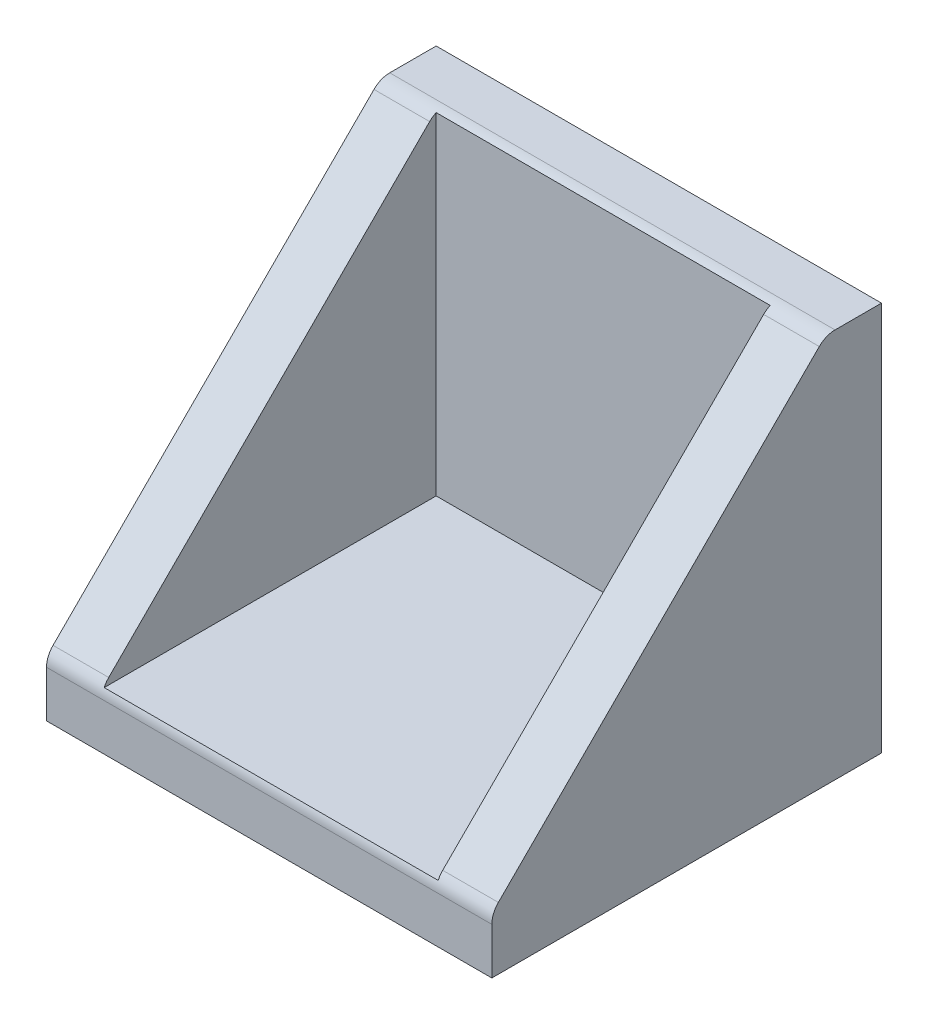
ISO-10303-21;
HEADER;
FILE_DESCRIPTION(('STEP AP214'),'2;1');
FILE_NAME('part.step','',(''),(''),'','','');
FILE_SCHEMA(('AUTOMOTIVE_DESIGN { 1 0 10303 214 1 1 1 1 }'));
ENDSEC;
DATA;
#1=APPLICATION_CONTEXT('core data for automotive mechanical design processes');
#2=APPLICATION_PROTOCOL_DEFINITION('international standard','automotive_design',2000,#1);
#3=PRODUCT_CONTEXT('',#1,'mechanical');
#4=PRODUCT('Part','Part','',(#3));
#5=PRODUCT_RELATED_PRODUCT_CATEGORY('part','',(#4));
#6=PRODUCT_DEFINITION_FORMATION('','',#4);
#7=PRODUCT_DEFINITION_CONTEXT('part definition',#1,'design');
#8=PRODUCT_DEFINITION('design','',#6,#7);
#9=PRODUCT_DEFINITION_SHAPE('','',#8);
#10=(LENGTH_UNIT() NAMED_UNIT(*) SI_UNIT(.MILLI.,.METRE.));
#11=(NAMED_UNIT(*) PLANE_ANGLE_UNIT() SI_UNIT($,.RADIAN.));
#12=(NAMED_UNIT(*) SI_UNIT($,.STERADIAN.) SOLID_ANGLE_UNIT());
#13=UNCERTAINTY_MEASURE_WITH_UNIT(LENGTH_MEASURE(1.E-05),#10,'distance_accuracy_value','');
#14=(GEOMETRIC_REPRESENTATION_CONTEXT(3) GLOBAL_UNCERTAINTY_ASSIGNED_CONTEXT((#13)) GLOBAL_UNIT_ASSIGNED_CONTEXT((#10,
#11,#12)) REPRESENTATION_CONTEXT('',''));
#15=CARTESIAN_POINT('',(0.,0.,0.));
#16=DIRECTION('',(0.,0.,1.));
#17=DIRECTION('',(1.,0.,0.));
#18=AXIS2_PLACEMENT_3D('',#15,#16,#17);
#19=CARTESIAN_POINT('',(15.,33.,-13.3284271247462));
#20=DIRECTION('',(-1.,0.,0.));
#21=DIRECTION('',(0.,0.,1.));
#22=AXIS2_PLACEMENT_3D('',#19,#20,#21);
#23=CYLINDRICAL_SURFACE('',#22,2.);
#24=DIRECTION('',(-1.,0.,0.));
#25=VECTOR('',#24,1.);
#26=CARTESIAN_POINT('',(15.,34.4142135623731,-11.9142135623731));
#27=LINE('',#26,#25);
#28=CARTESIAN_POINT('',(20.,34.4142135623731,-11.9142135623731));
#29=VERTEX_POINT('',#28);
#30=CARTESIAN_POINT('',(15.,34.4142135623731,-11.9142135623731));
#31=VERTEX_POINT('',#30);
#32=EDGE_CURVE('E227',#29,#31,#27,.T.);
#33=ORIENTED_EDGE('',*,*,#32,.F.);
#34=CARTESIAN_POINT('',(20.,33.,-13.3284271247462));
#35=DIRECTION('',(-1.,0.,0.));
#36=DIRECTION('',(0.,0.,1.));
#37=AXIS2_PLACEMENT_3D('',#34,#35,#36);
#38=CIRCLE('',#37,2.);
#39=CARTESIAN_POINT('',(20.,35.,-13.3284271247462));
#40=VERTEX_POINT('',#39);
#41=EDGE_CURVE('E11',#40,#29,#38,.F.);
#42=ORIENTED_EDGE('',*,*,#41,.F.);
#43=DIRECTION('',(-1.,0.,0.));
#44=VECTOR('',#43,1.);
#45=CARTESIAN_POINT('',(0.,35.,-13.3284271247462));
#46=LINE('',#45,#44);
#47=CARTESIAN_POINT('',(-20.,35.,-13.3284271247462));
#48=VERTEX_POINT('',#47);
#49=EDGE_CURVE('E51',#48,#40,#46,.F.);
#50=ORIENTED_EDGE('',*,*,#49,.F.);
#51=CARTESIAN_POINT('',(-20.,33.,-13.3284271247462));
#52=DIRECTION('',(1.,0.,0.));
#53=DIRECTION('',(0.,0.,-1.));
#54=AXIS2_PLACEMENT_3D('',#51,#52,#53);
#55=CIRCLE('',#54,2.);
#56=CARTESIAN_POINT('',(-20.,34.4142135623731,-11.9142135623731));
#57=VERTEX_POINT('',#56);
#58=EDGE_CURVE('E244',#57,#48,#55,.F.);
#59=ORIENTED_EDGE('',*,*,#58,.F.);
#60=DIRECTION('',(-1.,0.,0.));
#61=VECTOR('',#60,1.);
#62=CARTESIAN_POINT('',(15.,34.4142135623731,-11.9142135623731));
#63=LINE('',#62,#61);
#64=CARTESIAN_POINT('',(-15.,34.4142135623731,-11.9142135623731));
#65=VERTEX_POINT('',#64);
#66=EDGE_CURVE('E240',#65,#57,#63,.T.);
#67=ORIENTED_EDGE('',*,*,#66,.F.);
#68=CARTESIAN_POINT('',(-15.,33.,-13.3284271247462));
#69=DIRECTION('',(1.,0.,0.));
#70=DIRECTION('',(0.,0.,-1.));
#71=AXIS2_PLACEMENT_3D('',#68,#69,#70);
#72=CIRCLE('',#71,2.);
#73=CARTESIAN_POINT('',(-15.,34.8203594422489,-12.5));
#74=VERTEX_POINT('',#73);
#75=EDGE_CURVE('E237',#74,#65,#72,.T.);
#76=ORIENTED_EDGE('',*,*,#75,.F.);
#77=DIRECTION('',(-1.,0.,0.));
#78=VECTOR('',#77,1.);
#79=CARTESIAN_POINT('',(15.,34.8203594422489,-12.5));
#80=LINE('',#79,#78);
#81=CARTESIAN_POINT('',(15.,34.8203594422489,-12.5));
#82=VERTEX_POINT('',#81);
#83=EDGE_CURVE('E148',#82,#74,#80,.T.);
#84=ORIENTED_EDGE('',*,*,#83,.F.);
#85=CARTESIAN_POINT('',(15.,33.,-13.3284271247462));
#86=DIRECTION('',(-1.,0.,0.));
#87=DIRECTION('',(0.,0.,1.));
#88=AXIS2_PLACEMENT_3D('',#85,#86,#87);
#89=CIRCLE('',#88,2.);
#90=EDGE_CURVE('E231',#31,#82,#89,.T.);
#91=ORIENTED_EDGE('',*,*,#90,.F.);
#92=EDGE_LOOP('',(#33,#42,#50,#59,#67,#76,#84,#91));
#93=FACE_BOUND('',#92,.T.);
#94=ADVANCED_FACE('F43',(#93),#23,.T.);
#95=CARTESIAN_POINT('',(15.,4.17157287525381,15.5));
#96=DIRECTION('',(-1.,0.,0.));
#97=DIRECTION('',(0.,-1.,0.));
#98=AXIS2_PLACEMENT_3D('',#95,#96,#97);
#99=CYLINDRICAL_SURFACE('',#98,2.);
#100=DIRECTION('',(1.,0.,0.));
#101=VECTOR('',#100,1.);
#102=CARTESIAN_POINT('',(15.,5.58578643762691,16.9142135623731));
#103=LINE('',#102,#101);
#104=CARTESIAN_POINT('',(15.,5.58578643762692,16.9142135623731));
#105=VERTEX_POINT('',#104);
#106=CARTESIAN_POINT('',(20.,5.58578643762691,16.9142135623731));
#107=VERTEX_POINT('',#106);
#108=EDGE_CURVE('E199',#105,#107,#103,.T.);
#109=ORIENTED_EDGE('',*,*,#108,.F.);
#110=CARTESIAN_POINT('',(15.,4.17157287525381,15.5));
#111=DIRECTION('',(-1.,0.,0.));
#112=DIRECTION('',(0.,0.,1.));
#113=AXIS2_PLACEMENT_3D('',#110,#111,#112);
#114=CIRCLE('',#113,2.);
#115=CARTESIAN_POINT('',(15.,5.,17.3203594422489));
#116=VERTEX_POINT('',#115);
#117=EDGE_CURVE('E220',#116,#105,#114,.T.);
#118=ORIENTED_EDGE('',*,*,#117,.F.);
#119=DIRECTION('',(-1.,0.,0.));
#120=VECTOR('',#119,1.);
#121=CARTESIAN_POINT('',(15.,5.,17.3203594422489));
#122=LINE('',#121,#120);
#123=CARTESIAN_POINT('',(-15.,5.,17.3203594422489));
#124=VERTEX_POINT('',#123);
#125=EDGE_CURVE('E217',#124,#116,#122,.F.);
#126=ORIENTED_EDGE('',*,*,#125,.F.);
#127=CARTESIAN_POINT('',(-15.,4.17157287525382,15.5));
#128=DIRECTION('',(1.,0.,0.));
#129=DIRECTION('',(0.,0.,-1.));
#130=AXIS2_PLACEMENT_3D('',#127,#128,#129);
#131=CIRCLE('',#130,2.);
#132=CARTESIAN_POINT('',(-15.,5.58578643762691,16.9142135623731));
#133=VERTEX_POINT('',#132);
#134=EDGE_CURVE('E134',#133,#124,#131,.T.);
#135=ORIENTED_EDGE('',*,*,#134,.F.);
#136=DIRECTION('',(-1.,0.,0.));
#137=VECTOR('',#136,1.);
#138=CARTESIAN_POINT('',(15.,5.58578643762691,16.9142135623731));
#139=LINE('',#138,#137);
#140=CARTESIAN_POINT('',(-20.,5.58578643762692,16.9142135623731));
#141=VERTEX_POINT('',#140);
#142=EDGE_CURVE('E211',#141,#133,#139,.F.);
#143=ORIENTED_EDGE('',*,*,#142,.F.);
#144=CARTESIAN_POINT('',(-20.,4.17157287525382,15.5));
#145=DIRECTION('',(1.,0.,0.));
#146=DIRECTION('',(0.,0.,-1.));
#147=AXIS2_PLACEMENT_3D('',#144,#145,#146);
#148=CIRCLE('',#147,2.);
#149=CARTESIAN_POINT('',(-20.,4.17157287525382,17.5));
#150=VERTEX_POINT('',#149);
#151=EDGE_CURVE('E207',#150,#141,#148,.F.);
#152=ORIENTED_EDGE('',*,*,#151,.F.);
#153=DIRECTION('',(1.,0.,0.));
#154=VECTOR('',#153,1.);
#155=CARTESIAN_POINT('',(15.,4.17157287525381,17.5));
#156=LINE('',#155,#154);
#157=CARTESIAN_POINT('',(20.,4.17157287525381,17.5));
#158=VERTEX_POINT('',#157);
#159=EDGE_CURVE('E203',#158,#150,#156,.F.);
#160=ORIENTED_EDGE('',*,*,#159,.F.);
#161=CARTESIAN_POINT('',(20.,4.17157287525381,15.5));
#162=DIRECTION('',(-1.,0.,0.));
#163=DIRECTION('',(0.,0.,1.));
#164=AXIS2_PLACEMENT_3D('',#161,#162,#163);
#165=CIRCLE('',#164,2.);
#166=EDGE_CURVE('E224',#107,#158,#165,.F.);
#167=ORIENTED_EDGE('',*,*,#166,.F.);
#168=EDGE_LOOP('',(#109,#118,#126,#135,#143,#152,#160,#167));
#169=FACE_BOUND('',#168,.T.);
#170=ADVANCED_FACE('F278',(#169),#99,.T.);
#171=CARTESIAN_POINT('',(20.,5.,-17.5));
#172=DIRECTION('',(-1.,0.,0.));
#173=DIRECTION('',(0.,0.,1.));
#174=AXIS2_PLACEMENT_3D('',#171,#172,#173);
#175=PLANE('',#174);
#176=DIRECTION('',(0.,0.,-1.));
#177=VECTOR('',#176,1.);
#178=CARTESIAN_POINT('',(20.,35.,-17.5));
#179=LINE('',#178,#177);
#180=CARTESIAN_POINT('',(20.,35.,-17.5));
#181=VERTEX_POINT('',#180);
#182=EDGE_CURVE('E162',#40,#181,#179,.T.);
#183=ORIENTED_EDGE('',*,*,#182,.F.);
#184=ORIENTED_EDGE('',*,*,#41,.T.);
#185=DIRECTION('',(0.,-0.707106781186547,0.707106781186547));
#186=VECTOR('',#185,1.);
#187=CARTESIAN_POINT('',(20.,35.,-12.5));
#188=LINE('',#187,#186);
#189=EDGE_CURVE('E261',#29,#107,#188,.T.);
#190=ORIENTED_EDGE('',*,*,#189,.T.);
#191=ORIENTED_EDGE('',*,*,#166,.T.);
#192=DIRECTION('',(0.,-1.,0.));
#193=VECTOR('',#192,1.);
#194=CARTESIAN_POINT('',(20.,5.,17.5));
#195=LINE('',#194,#193);
#196=CARTESIAN_POINT('',(20.,0.,17.5));
#197=VERTEX_POINT('',#196);
#198=EDGE_CURVE('E185',#158,#197,#195,.T.);
#199=ORIENTED_EDGE('',*,*,#198,.T.);
#200=DIRECTION('',(0.,0.,-1.));
#201=VECTOR('',#200,1.);
#202=CARTESIAN_POINT('',(20.,0.,-17.5));
#203=LINE('',#202,#201);
#204=CARTESIAN_POINT('',(20.,0.,-17.5));
#205=VERTEX_POINT('',#204);
#206=EDGE_CURVE('E170',#197,#205,#203,.T.);
#207=ORIENTED_EDGE('',*,*,#206,.T.);
#208=DIRECTION('',(0.,-1.,0.));
#209=VECTOR('',#208,1.);
#210=CARTESIAN_POINT('',(20.,5.,-17.5));
#211=LINE('',#210,#209);
#212=EDGE_CURVE('E195',#181,#205,#211,.T.);
#213=ORIENTED_EDGE('',*,*,#212,.F.);
#214=EDGE_LOOP('',(#183,#184,#190,#191,#199,#207,#213));
#215=FACE_BOUND('',#214,.T.);
#216=ADVANCED_FACE('F255',(#215),#175,.F.);
#217=CARTESIAN_POINT('',(-20.,5.,-17.5));
#218=DIRECTION('',(0.,0.,1.));
#219=DIRECTION('',(1.,0.,0.));
#220=AXIS2_PLACEMENT_3D('',#217,#218,#219);
#221=PLANE('',#220);
#222=DIRECTION('',(-1.,0.,0.));
#223=VECTOR('',#222,1.);
#224=CARTESIAN_POINT('',(-20.,0.,-17.5));
#225=LINE('',#224,#223);
#226=CARTESIAN_POINT('',(-20.,0.,-17.5));
#227=VERTEX_POINT('',#226);
#228=EDGE_CURVE('E174',#205,#227,#225,.T.);
#229=ORIENTED_EDGE('',*,*,#228,.T.);
#230=DIRECTION('',(0.,-1.,0.));
#231=VECTOR('',#230,1.);
#232=CARTESIAN_POINT('',(-20.,5.,-17.5));
#233=LINE('',#232,#231);
#234=CARTESIAN_POINT('',(-20.,35.,-17.5));
#235=VERTEX_POINT('',#234);
#236=EDGE_CURVE('E191',#235,#227,#233,.T.);
#237=ORIENTED_EDGE('',*,*,#236,.F.);
#238=DIRECTION('',(-1.,0.,0.));
#239=VECTOR('',#238,1.);
#240=CARTESIAN_POINT('',(-20.,35.,-17.5));
#241=LINE('',#240,#239);
#242=EDGE_CURVE('E168',#181,#235,#241,.T.);
#243=ORIENTED_EDGE('',*,*,#242,.F.);
#244=ORIENTED_EDGE('',*,*,#212,.T.);
#245=EDGE_LOOP('',(#229,#237,#243,#244));
#246=FACE_BOUND('',#245,.T.);
#247=ADVANCED_FACE('F307',(#246),#221,.F.);
#248=CARTESIAN_POINT('',(-20.,5.,-17.5));
#249=DIRECTION('',(1.,0.,0.));
#250=DIRECTION('',(0.,0.,-1.));
#251=AXIS2_PLACEMENT_3D('',#248,#249,#250);
#252=PLANE('',#251);
#253=DIRECTION('',(0.,-0.707106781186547,0.707106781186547));
#254=VECTOR('',#253,1.);
#255=CARTESIAN_POINT('',(-20.,35.,-12.5));
#256=LINE('',#255,#254);
#257=EDGE_CURVE('E150',#57,#141,#256,.T.);
#258=ORIENTED_EDGE('',*,*,#257,.F.);
#259=ORIENTED_EDGE('',*,*,#58,.T.);
#260=DIRECTION('',(0.,0.,1.));
#261=VECTOR('',#260,1.);
#262=CARTESIAN_POINT('',(-20.,35.,-17.5));
#263=LINE('',#262,#261);
#264=EDGE_CURVE('E156',#235,#48,#263,.T.);
#265=ORIENTED_EDGE('',*,*,#264,.F.);
#266=ORIENTED_EDGE('',*,*,#236,.T.);
#267=DIRECTION('',(0.,0.,1.));
#268=VECTOR('',#267,1.);
#269=CARTESIAN_POINT('',(-20.,0.,-17.5));
#270=LINE('',#269,#268);
#271=CARTESIAN_POINT('',(-20.,0.,17.5));
#272=VERTEX_POINT('',#271);
#273=EDGE_CURVE('E177',#227,#272,#270,.T.);
#274=ORIENTED_EDGE('',*,*,#273,.T.);
#275=DIRECTION('',(0.,-1.,0.));
#276=VECTOR('',#275,1.);
#277=CARTESIAN_POINT('',(-20.,5.,17.5));
#278=LINE('',#277,#276);
#279=EDGE_CURVE('E188',#150,#272,#278,.T.);
#280=ORIENTED_EDGE('',*,*,#279,.F.);
#281=ORIENTED_EDGE('',*,*,#151,.T.);
#282=EDGE_LOOP('',(#258,#259,#265,#266,#274,#280,#281));
#283=FACE_BOUND('',#282,.T.);
#284=ADVANCED_FACE('F282',(#283),#252,.F.);
#285=CARTESIAN_POINT('',(-20.,5.,17.5));
#286=DIRECTION('',(0.,0.,-1.));
#287=DIRECTION('',(-1.,0.,0.));
#288=AXIS2_PLACEMENT_3D('',#285,#286,#287);
#289=PLANE('',#288);
#290=ORIENTED_EDGE('',*,*,#198,.F.);
#291=ORIENTED_EDGE('',*,*,#159,.T.);
#292=ORIENTED_EDGE('',*,*,#279,.T.);
#293=DIRECTION('',(1.,0.,0.));
#294=VECTOR('',#293,1.);
#295=CARTESIAN_POINT('',(-20.,0.,17.5));
#296=LINE('',#295,#294);
#297=EDGE_CURVE('E181',#272,#197,#296,.T.);
#298=ORIENTED_EDGE('',*,*,#297,.T.);
#299=EDGE_LOOP('',(#290,#291,#292,#298));
#300=FACE_BOUND('',#299,.T.);
#301=ADVANCED_FACE('F288',(#300),#289,.F.);
#302=CARTESIAN_POINT('',(0.,5.,0.));
#303=DIRECTION('',(0.,1.,0.));
#304=DIRECTION('',(0.,0.,1.));
#305=AXIS2_PLACEMENT_3D('',#302,#303,#304);
#306=PLANE('',#305);
#307=DIRECTION('',(0.,0.,-1.));
#308=VECTOR('',#307,1.);
#309=CARTESIAN_POINT('',(-15.,5.,17.5));
#310=LINE('',#309,#308);
#311=CARTESIAN_POINT('',(-15.,5.,-12.5));
#312=VERTEX_POINT('',#311);
#313=EDGE_CURVE('E128',#124,#312,#310,.T.);
#314=ORIENTED_EDGE('',*,*,#313,.F.);
#315=ORIENTED_EDGE('',*,*,#125,.T.);
#316=DIRECTION('',(0.,0.,-1.));
#317=VECTOR('',#316,1.);
#318=CARTESIAN_POINT('',(15.,5.,17.5));
#319=LINE('',#318,#317);
#320=CARTESIAN_POINT('',(15.,5.,-12.5));
#321=VERTEX_POINT('',#320);
#322=EDGE_CURVE('E154',#116,#321,#319,.T.);
#323=ORIENTED_EDGE('',*,*,#322,.T.);
#324=DIRECTION('',(1.,0.,0.));
#325=VECTOR('',#324,1.);
#326=CARTESIAN_POINT('',(-20.,5.,-12.5));
#327=LINE('',#326,#325);
#328=EDGE_CURVE('E146',#312,#321,#327,.T.);
#329=ORIENTED_EDGE('',*,*,#328,.F.);
#330=EDGE_LOOP('',(#314,#315,#323,#329));
#331=FACE_BOUND('',#330,.T.);
#332=ADVANCED_FACE('F152',(#331),#306,.T.);
#333=CARTESIAN_POINT('',(0.,0.,0.));
#334=DIRECTION('',(0.,1.,0.));
#335=DIRECTION('',(0.,0.,1.));
#336=AXIS2_PLACEMENT_3D('',#333,#334,#335);
#337=PLANE('',#336);
#338=ORIENTED_EDGE('',*,*,#206,.F.);
#339=ORIENTED_EDGE('',*,*,#297,.F.);
#340=ORIENTED_EDGE('',*,*,#273,.F.);
#341=ORIENTED_EDGE('',*,*,#228,.F.);
#342=EDGE_LOOP('',(#338,#339,#340,#341));
#343=FACE_BOUND('',#342,.T.);
#344=ADVANCED_FACE('F315',(#343),#337,.F.);
#345=CARTESIAN_POINT('',(-20.,35.,-12.5));
#346=DIRECTION('',(0.,0.,-1.));
#347=DIRECTION('',(-1.,0.,0.));
#348=AXIS2_PLACEMENT_3D('',#345,#346,#347);
#349=PLANE('',#348);
#350=DIRECTION('',(0.,1.,0.));
#351=VECTOR('',#350,1.);
#352=CARTESIAN_POINT('',(15.,5.,-12.5));
#353=LINE('',#352,#351);
#354=EDGE_CURVE('E263',#321,#82,#353,.T.);
#355=ORIENTED_EDGE('',*,*,#354,.T.);
#356=ORIENTED_EDGE('',*,*,#83,.T.);
#357=DIRECTION('',(0.,1.,0.));
#358=VECTOR('',#357,1.);
#359=CARTESIAN_POINT('',(-15.,5.,-12.5));
#360=LINE('',#359,#358);
#361=EDGE_CURVE('E132',#312,#74,#360,.T.);
#362=ORIENTED_EDGE('',*,*,#361,.F.);
#363=ORIENTED_EDGE('',*,*,#328,.T.);
#364=EDGE_LOOP('',(#355,#356,#362,#363));
#365=FACE_BOUND('',#364,.T.);
#366=ADVANCED_FACE('F145',(#365),#349,.F.);
#367=CARTESIAN_POINT('',(0.,35.,0.));
#368=DIRECTION('',(0.,1.,0.));
#369=DIRECTION('',(0.,0.,1.));
#370=AXIS2_PLACEMENT_3D('',#367,#368,#369);
#371=PLANE('',#370);
#372=ORIENTED_EDGE('',*,*,#264,.T.);
#373=ORIENTED_EDGE('',*,*,#49,.T.);
#374=ORIENTED_EDGE('',*,*,#182,.T.);
#375=ORIENTED_EDGE('',*,*,#242,.T.);
#376=EDGE_LOOP('',(#372,#373,#374,#375));
#377=FACE_BOUND('',#376,.T.);
#378=ADVANCED_FACE('F250',(#377),#371,.T.);
#379=CARTESIAN_POINT('',(15.,35.,-12.5));
#380=DIRECTION('',(0.,0.707106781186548,0.707106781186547));
#381=DIRECTION('',(0.,-0.707106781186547,0.707106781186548));
#382=AXIS2_PLACEMENT_3D('',#379,#380,#381);
#383=PLANE('',#382);
#384=ORIENTED_EDGE('',*,*,#189,.F.);
#385=ORIENTED_EDGE('',*,*,#32,.T.);
#386=DIRECTION('',(0.,-0.707106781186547,0.707106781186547));
#387=VECTOR('',#386,1.);
#388=CARTESIAN_POINT('',(15.,35.,-12.5));
#389=LINE('',#388,#387);
#390=EDGE_CURVE('E164',#31,#105,#389,.T.);
#391=ORIENTED_EDGE('',*,*,#390,.T.);
#392=ORIENTED_EDGE('',*,*,#108,.T.);
#393=EDGE_LOOP('',(#384,#385,#391,#392));
#394=FACE_BOUND('',#393,.T.);
#395=ADVANCED_FACE('F293',(#394),#383,.T.);
#396=CARTESIAN_POINT('',(15.,0.,0.));
#397=DIRECTION('',(-1.,0.,0.));
#398=DIRECTION('',(0.,0.,1.));
#399=AXIS2_PLACEMENT_3D('',#396,#397,#398);
#400=PLANE('',#399);
#401=ORIENTED_EDGE('',*,*,#390,.F.);
#402=ORIENTED_EDGE('',*,*,#90,.T.);
#403=ORIENTED_EDGE('',*,*,#354,.F.);
#404=ORIENTED_EDGE('',*,*,#322,.F.);
#405=ORIENTED_EDGE('',*,*,#117,.T.);
#406=EDGE_LOOP('',(#401,#402,#403,#404,#405));
#407=FACE_BOUND('',#406,.T.);
#408=ADVANCED_FACE('F296',(#407),#400,.T.);
#409=CARTESIAN_POINT('',(-15.,35.,-12.5));
#410=DIRECTION('',(0.,-0.707106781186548,-0.707106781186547));
#411=DIRECTION('',(0.,0.707106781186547,-0.707106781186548));
#412=AXIS2_PLACEMENT_3D('',#409,#410,#411);
#413=PLANE('',#412);
#414=DIRECTION('',(0.,-0.707106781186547,0.707106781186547));
#415=VECTOR('',#414,1.);
#416=CARTESIAN_POINT('',(-15.,35.,-12.5));
#417=LINE('',#416,#415);
#418=EDGE_CURVE('E139',#65,#133,#417,.T.);
#419=ORIENTED_EDGE('',*,*,#418,.F.);
#420=ORIENTED_EDGE('',*,*,#66,.T.);
#421=ORIENTED_EDGE('',*,*,#257,.T.);
#422=ORIENTED_EDGE('',*,*,#142,.T.);
#423=EDGE_LOOP('',(#419,#420,#421,#422));
#424=FACE_BOUND('',#423,.T.);
#425=ADVANCED_FACE('F279',(#424),#413,.F.);
#426=CARTESIAN_POINT('',(-15.,0.,0.));
#427=DIRECTION('',(1.,0.,0.));
#428=DIRECTION('',(0.,0.,1.));
#429=AXIS2_PLACEMENT_3D('',#426,#427,#428);
#430=PLANE('',#429);
#431=ORIENTED_EDGE('',*,*,#361,.T.);
#432=ORIENTED_EDGE('',*,*,#75,.T.);
#433=ORIENTED_EDGE('',*,*,#418,.T.);
#434=ORIENTED_EDGE('',*,*,#134,.T.);
#435=ORIENTED_EDGE('',*,*,#313,.T.);
#436=EDGE_LOOP('',(#431,#432,#433,#434,#435));
#437=FACE_BOUND('',#436,.T.);
#438=ADVANCED_FACE('F130',(#437),#430,.T.);
#439=CLOSED_SHELL('',(#94,#170,#216,#247,#284,#301,#332,#344,#366,#378,#395,#408,#425,#438));
#440=MANIFOLD_SOLID_BREP('B2',#439);
#441=ADVANCED_BREP_SHAPE_REPRESENTATION('',(#18,#440),#14);
#442=SHAPE_DEFINITION_REPRESENTATION(#9,#441);
ENDSEC;
END-ISO-10303-21;
